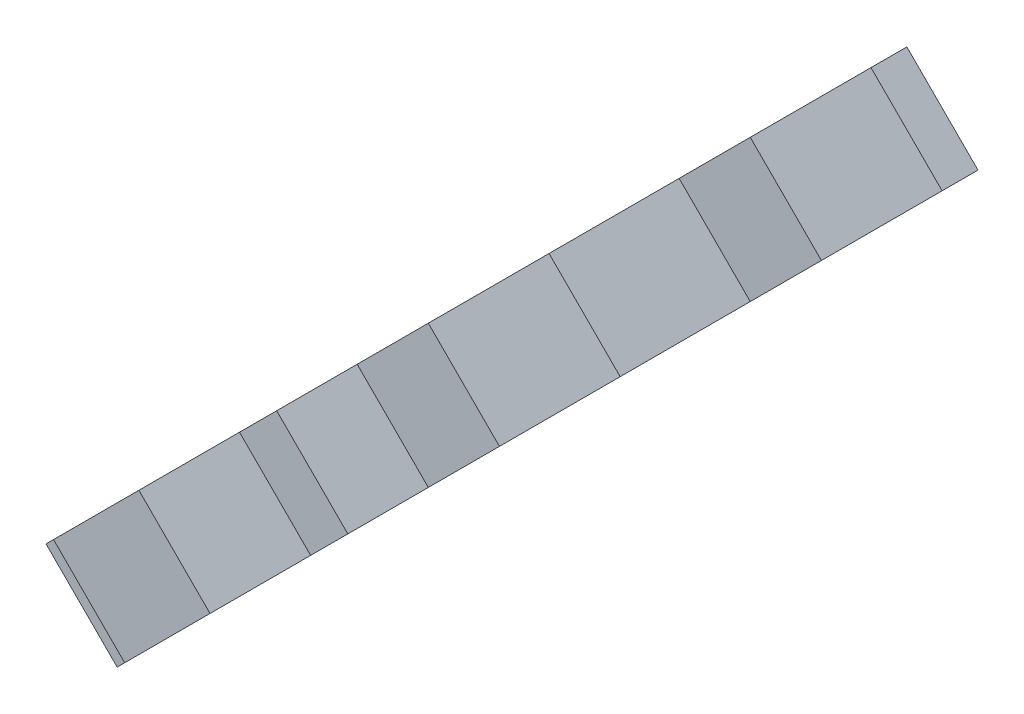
from build123d import *

# Parameters (mm, degrees)
BOSS_EXTRUDE1_DEPTH = 6.35
BOSS_EXTRUDE3_DEPTH = 6.35
SKETCH12_W          = 10.795
SKETCH12_H          = 6.35
SKETCH12_W_2        = 12.7
SKETCH12_W_3        = 5.08
SKETCH12_W_4        = 10.16
SKETCH12_H_2        = 8.9662
CUT_EXTRUDE2_DEPTH  = 15.24


with BuildPart() as part:
    # Sketch8 → Boss-Extrude1 (new body)
    with BuildSketch(Plane(origin=(0, 0, 0), x_dir=(0.7071067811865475, 0.7071067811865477, 0), z_dir=(-0.7071067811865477, 0.7071067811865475, 0))):
        Polygon((0, 0), (26.940768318, 0), (26.940768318, 43.815), (0, 26.67), align=None)
    extrude(amount=BOSS_EXTRUDE1_DEPTH)

    # Sketch13 → Boss-Extrude3 (add)
    with BuildSketch(Plane.XY):
        Polygon((2.334866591, 11.315122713), (6.824994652, 6.824994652), (12.213148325, 12.213148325), (7.723020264, 16.703276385), align=None)
    extrude(amount=BOSS_EXTRUDE3_DEPTH)

    # Sketch12 → Cut-Extrude2 (cut)
    with BuildSketch(Plane(origin=(-4.490128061, 4.490128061, 0), x_dir=(0, 0, 1), z_dir=(-0.7071067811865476, 0.7071067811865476, 0))):
        with Locations((-38.4175, 23.765768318)):
            Rectangle(SKETCH12_W, SKETCH12_H)
        with Locations((-19.05, 23.765768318)):
            Rectangle(SKETCH12_W_2, SKETCH12_H)
        with Locations((-2.54, 23.765768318)):
            Rectangle(SKETCH12_W_3, SKETCH12_H)
        with Locations((-15.24, 4.4831)):
            Rectangle(SKETCH12_W_4, SKETCH12_H_2)
    extrude(amount=-CUT_EXTRUDE2_DEPTH, mode=Mode.SUBTRACT)


solid = part.part
